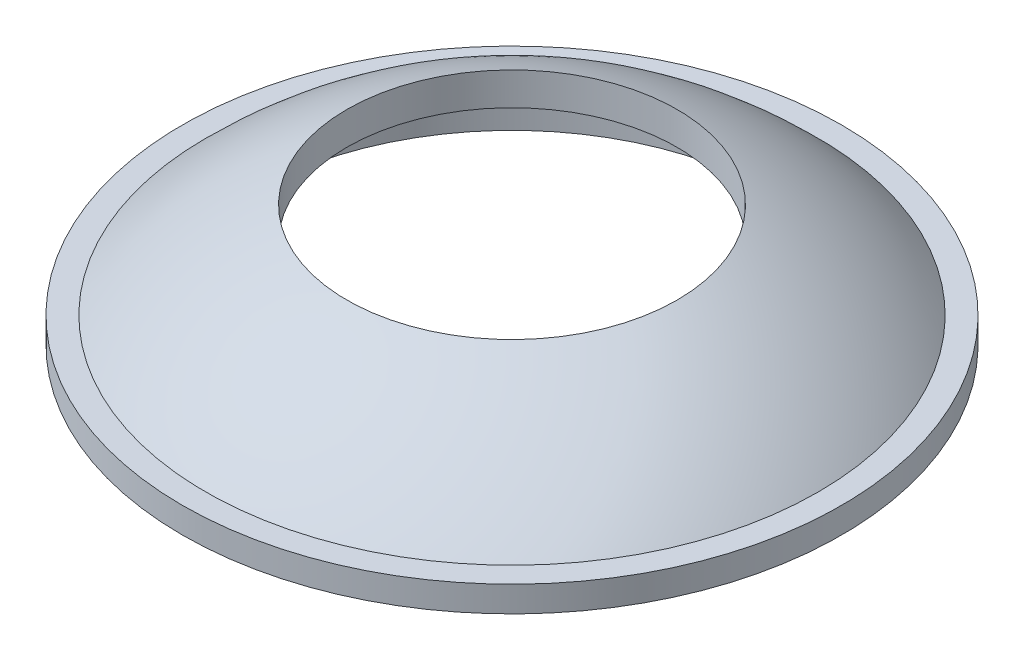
from build123d import *

# Parameters (mm, degrees)
CUT_EXTRUDE1_DEPTH      = 13
CUT_EXTRUDE1_DEPTH_BACK = 14
SKETCH2_W               = 28.47073839
SKETCH2_H               = 6.4
SKETCH3_R               = 7.683749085
SKETCH3_R_2             = 6.125
BOSS_EXTRUDE1_DEPTH     = 0.6
SKETCH4_R               = 3.85
CUT_EXTRUDE2_DEPTH      = 7.3


with BuildPart() as part:
    # Sketch1 → Revolve1 (revolve)
    with BuildSketch(Plane.XY):
        with BuildLine():
            Line((0, 9.3), (0, 10))
            ThreePointArc((0, 10), (7.071067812, 7.071067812), (10, 0))
            Line((10, 0), (9.3, 0))
            ThreePointArc((9.3, 0), (6.576093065, 6.576093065), (0, 9.3))
        make_face()
    revolve(axis=Axis((0, 0, 0), (0, 1, 0)))

    # Sketch2 → Cut-Extrude1 (cut, two sides: drawn at the far end of the back side and taken through both)
    with BuildSketch(Plane(origin=(0, 0, 0), x_dir=(0, 0, -1), z_dir=(1, 0, 0)).offset(-CUT_EXTRUDE1_DEPTH_BACK)):
        with Locations((0, 3.2)):
            Rectangle(SKETCH2_W, SKETCH2_H)
    extrude(amount=CUT_EXTRUDE1_DEPTH + CUT_EXTRUDE1_DEPTH_BACK, mode=Mode.SUBTRACT)

    # Sketch3 → Boss-Extrude1 (add)
    with BuildSketch(Plane.XZ.offset(-6.4)):
        with Locations(Location((0, 0, 0), (0, 0, 270))):
            Circle(SKETCH3_R)
        with Locations(Location((0, 0, 0), (0, 0, 270))):
            Circle(SKETCH3_R_2, mode=Mode.SUBTRACT)
    extrude(amount=-BOSS_EXTRUDE1_DEPTH)

    # Sketch4 → Cut-Extrude2 (cut)
    with BuildSketch(Plane.XZ.offset(-6.4)):
        Circle(SKETCH4_R)
    extrude(amount=-CUT_EXTRUDE2_DEPTH, mode=Mode.SUBTRACT)


solid = part.part
